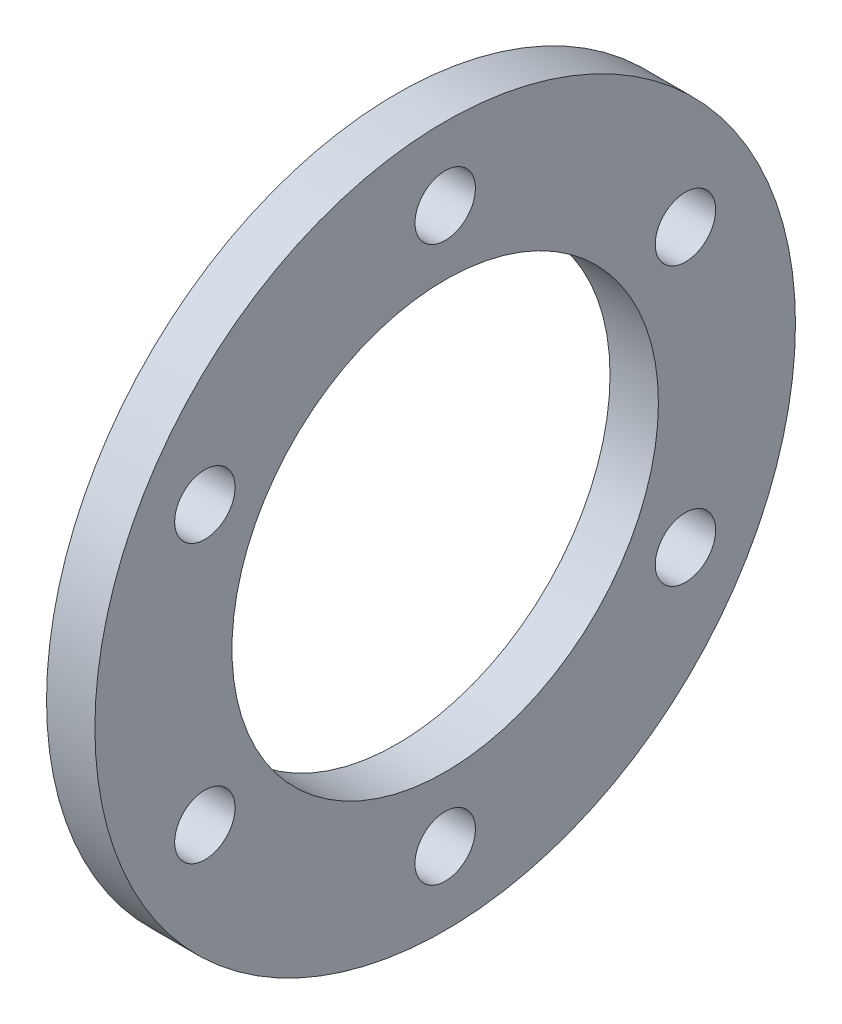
ISO-10303-21;
HEADER;
FILE_DESCRIPTION(('STEP AP214'),'2;1');
FILE_NAME('part.step','',(''),(''),'','','');
FILE_SCHEMA(('AUTOMOTIVE_DESIGN { 1 0 10303 214 1 1 1 1 }'));
ENDSEC;
DATA;
#1=APPLICATION_CONTEXT('core data for automotive mechanical design processes');
#2=APPLICATION_PROTOCOL_DEFINITION('international standard','automotive_design',2000,#1);
#3=PRODUCT_CONTEXT('',#1,'mechanical');
#4=PRODUCT('Part','Part','',(#3));
#5=PRODUCT_RELATED_PRODUCT_CATEGORY('part','',(#4));
#6=PRODUCT_DEFINITION_FORMATION('','',#4);
#7=PRODUCT_DEFINITION_CONTEXT('part definition',#1,'design');
#8=PRODUCT_DEFINITION('design','',#6,#7);
#9=PRODUCT_DEFINITION_SHAPE('','',#8);
#10=(LENGTH_UNIT() NAMED_UNIT(*) SI_UNIT(.MILLI.,.METRE.));
#11=(NAMED_UNIT(*) PLANE_ANGLE_UNIT() SI_UNIT($,.RADIAN.));
#12=(NAMED_UNIT(*) SI_UNIT($,.STERADIAN.) SOLID_ANGLE_UNIT());
#13=UNCERTAINTY_MEASURE_WITH_UNIT(LENGTH_MEASURE(1.E-05),#10,'distance_accuracy_value','');
#14=(GEOMETRIC_REPRESENTATION_CONTEXT(3) GLOBAL_UNCERTAINTY_ASSIGNED_CONTEXT((#13)) GLOBAL_UNIT_ASSIGNED_CONTEXT((#10,
#11,#12)) REPRESENTATION_CONTEXT('',''));
#15=CARTESIAN_POINT('',(0.,0.,0.));
#16=DIRECTION('',(0.,0.,1.));
#17=DIRECTION('',(1.,0.,0.));
#18=AXIS2_PLACEMENT_3D('',#15,#16,#17);
#19=CARTESIAN_POINT('',(6.35,0.,0.));
#20=DIRECTION('',(1.,0.,0.));
#21=DIRECTION('',(0.,0.,-1.));
#22=AXIS2_PLACEMENT_3D('',#19,#20,#21);
#23=PLANE('',#22);
#24=CARTESIAN_POINT('',(6.35,18.2176562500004,31.5539062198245));
#25=DIRECTION('',(1.,0.,0.));
#26=DIRECTION('',(0.,0.866025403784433,-0.50000000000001));
#27=AXIS2_PLACEMENT_3D('',#24,#25,#26);
#28=CIRCLE('',#27,3.96875);
#29=CARTESIAN_POINT('',(6.35,21.6546945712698,29.5695312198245));
#30=VERTEX_POINT('',#29);
#31=EDGE_CURVE('E82',#30,#30,#28,.T.);
#32=ORIENTED_EDGE('',*,*,#31,.F.);
#33=EDGE_LOOP('',(#32));
#34=FACE_BOUND('',#33,.T.);
#35=CARTESIAN_POINT('',(6.35,-18.2176562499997,31.5539062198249));
#36=DIRECTION('',(1.,0.,0.));
#37=DIRECTION('',(0.,0.866025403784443,0.499999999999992));
#38=AXIS2_PLACEMENT_3D('',#35,#36,#37);
#39=CIRCLE('',#38,3.96875);
#40=CARTESIAN_POINT('',(6.35,-14.7806179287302,33.5382812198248));
#41=VERTEX_POINT('',#40);
#42=EDGE_CURVE('E76',#41,#41,#39,.T.);
#43=ORIENTED_EDGE('',*,*,#42,.F.);
#44=EDGE_LOOP('',(#43));
#45=FACE_BOUND('',#44,.T.);
#46=CARTESIAN_POINT('',(6.35,-36.4353125,0.));
#47=DIRECTION('',(1.,0.,0.));
#48=DIRECTION('',(0.,0.,1.));
#49=AXIS2_PLACEMENT_3D('',#46,#47,#48);
#50=CIRCLE('',#49,3.96875);
#51=CARTESIAN_POINT('',(6.35,-36.4353125,3.96875));
#52=VERTEX_POINT('',#51);
#53=EDGE_CURVE('E70',#52,#52,#50,.T.);
#54=ORIENTED_EDGE('',*,*,#53,.F.);
#55=EDGE_LOOP('',(#54));
#56=FACE_BOUND('',#55,.T.);
#57=CARTESIAN_POINT('',(6.35,-18.2176562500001,-31.5539062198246));
#58=DIRECTION('',(1.,0.,0.));
#59=DIRECTION('',(0.,-0.866025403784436,0.500000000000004));
#60=AXIS2_PLACEMENT_3D('',#57,#58,#59);
#61=CIRCLE('',#60,3.96875);
#62=CARTESIAN_POINT('',(6.35,-21.6546945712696,-29.5695312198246));
#63=VERTEX_POINT('',#62);
#64=EDGE_CURVE('E64',#63,#63,#61,.T.);
#65=ORIENTED_EDGE('',*,*,#64,.F.);
#66=EDGE_LOOP('',(#65));
#67=FACE_BOUND('',#66,.T.);
#68=CARTESIAN_POINT('',(6.35,18.2176562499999,-31.5539062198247));
#69=DIRECTION('',(1.,0.,0.));
#70=DIRECTION('',(0.,-0.86602540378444,-0.499999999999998));
#71=AXIS2_PLACEMENT_3D('',#68,#69,#70);
#72=CIRCLE('',#71,3.96875);
#73=CARTESIAN_POINT('',(6.35,14.7806179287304,-33.5382812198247));
#74=VERTEX_POINT('',#73);
#75=EDGE_CURVE('E58',#74,#74,#72,.T.);
#76=ORIENTED_EDGE('',*,*,#75,.F.);
#77=EDGE_LOOP('',(#76));
#78=FACE_BOUND('',#77,.T.);
#79=CARTESIAN_POINT('',(6.35,36.4353125,0.));
#80=DIRECTION('',(1.,0.,0.));
#81=DIRECTION('',(0.,0.,-1.));
#82=AXIS2_PLACEMENT_3D('',#79,#80,#81);
#83=CIRCLE('',#82,3.96875);
#84=CARTESIAN_POINT('',(6.35,36.4353125,-3.96875));
#85=VERTEX_POINT('',#84);
#86=EDGE_CURVE('E52',#85,#85,#83,.T.);
#87=ORIENTED_EDGE('',*,*,#86,.F.);
#88=EDGE_LOOP('',(#87));
#89=FACE_BOUND('',#88,.T.);
#90=CARTESIAN_POINT('',(6.35,0.,0.));
#91=DIRECTION('',(1.,0.,0.));
#92=DIRECTION('',(0.,0.,-1.));
#93=AXIS2_PLACEMENT_3D('',#90,#91,#92);
#94=CIRCLE('',#93,46.);
#95=CARTESIAN_POINT('',(6.35,0.,-46.));
#96=VERTEX_POINT('',#95);
#97=EDGE_CURVE('E10',#96,#96,#94,.T.);
#98=ORIENTED_EDGE('',*,*,#97,.T.);
#99=EDGE_LOOP('',(#98));
#100=FACE_BOUND('',#99,.T.);
#101=CARTESIAN_POINT('',(6.35,0.,0.));
#102=DIRECTION('',(1.,0.,0.));
#103=DIRECTION('',(0.,0.,-1.));
#104=AXIS2_PLACEMENT_3D('',#101,#102,#103);
#105=CIRCLE('',#104,28.);
#106=CARTESIAN_POINT('',(6.35,0.,-28.));
#107=VERTEX_POINT('',#106);
#108=EDGE_CURVE('E44',#107,#107,#105,.T.);
#109=ORIENTED_EDGE('',*,*,#108,.F.);
#110=EDGE_LOOP('',(#109));
#111=FACE_BOUND('',#110,.T.);
#112=ADVANCED_FACE('F33',(#34,#45,#56,#67,#78,#89,#100,#111),#23,.T.);
#113=CARTESIAN_POINT('',(0.,0.,0.));
#114=DIRECTION('',(1.,0.,0.));
#115=DIRECTION('',(0.,0.,-1.));
#116=AXIS2_PLACEMENT_3D('',#113,#114,#115);
#117=PLANE('',#116);
#118=CARTESIAN_POINT('',(0.,18.2176562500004,31.5539062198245));
#119=DIRECTION('',(1.,0.,0.));
#120=DIRECTION('',(0.,0.866025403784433,-0.50000000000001));
#121=AXIS2_PLACEMENT_3D('',#118,#119,#120);
#122=CIRCLE('',#121,3.96875);
#123=CARTESIAN_POINT('',(0.,21.6546945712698,29.5695312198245));
#124=VERTEX_POINT('',#123);
#125=EDGE_CURVE('E79',#124,#124,#122,.T.);
#126=ORIENTED_EDGE('',*,*,#125,.T.);
#127=EDGE_LOOP('',(#126));
#128=FACE_BOUND('',#127,.T.);
#129=CARTESIAN_POINT('',(0.,-18.2176562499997,31.5539062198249));
#130=DIRECTION('',(1.,0.,0.));
#131=DIRECTION('',(0.,0.866025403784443,0.499999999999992));
#132=AXIS2_PLACEMENT_3D('',#129,#130,#131);
#133=CIRCLE('',#132,3.96875);
#134=CARTESIAN_POINT('',(0.,-14.7806179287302,33.5382812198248));
#135=VERTEX_POINT('',#134);
#136=EDGE_CURVE('E73',#135,#135,#133,.T.);
#137=ORIENTED_EDGE('',*,*,#136,.T.);
#138=EDGE_LOOP('',(#137));
#139=FACE_BOUND('',#138,.T.);
#140=CARTESIAN_POINT('',(0.,-36.4353125,0.));
#141=DIRECTION('',(1.,0.,0.));
#142=DIRECTION('',(0.,0.,1.));
#143=AXIS2_PLACEMENT_3D('',#140,#141,#142);
#144=CIRCLE('',#143,3.96875);
#145=CARTESIAN_POINT('',(0.,-36.4353125,3.96875));
#146=VERTEX_POINT('',#145);
#147=EDGE_CURVE('E67',#146,#146,#144,.T.);
#148=ORIENTED_EDGE('',*,*,#147,.T.);
#149=EDGE_LOOP('',(#148));
#150=FACE_BOUND('',#149,.T.);
#151=CARTESIAN_POINT('',(0.,-18.2176562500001,-31.5539062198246));
#152=DIRECTION('',(1.,0.,0.));
#153=DIRECTION('',(0.,-0.866025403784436,0.500000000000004));
#154=AXIS2_PLACEMENT_3D('',#151,#152,#153);
#155=CIRCLE('',#154,3.96875);
#156=CARTESIAN_POINT('',(0.,-21.6546945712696,-29.5695312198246));
#157=VERTEX_POINT('',#156);
#158=EDGE_CURVE('E61',#157,#157,#155,.T.);
#159=ORIENTED_EDGE('',*,*,#158,.T.);
#160=EDGE_LOOP('',(#159));
#161=FACE_BOUND('',#160,.T.);
#162=CARTESIAN_POINT('',(0.,18.2176562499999,-31.5539062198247));
#163=DIRECTION('',(1.,0.,0.));
#164=DIRECTION('',(0.,-0.86602540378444,-0.499999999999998));
#165=AXIS2_PLACEMENT_3D('',#162,#163,#164);
#166=CIRCLE('',#165,3.96875);
#167=CARTESIAN_POINT('',(0.,14.7806179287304,-33.5382812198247));
#168=VERTEX_POINT('',#167);
#169=EDGE_CURVE('E55',#168,#168,#166,.T.);
#170=ORIENTED_EDGE('',*,*,#169,.T.);
#171=EDGE_LOOP('',(#170));
#172=FACE_BOUND('',#171,.T.);
#173=CARTESIAN_POINT('',(0.,36.4353125,0.));
#174=DIRECTION('',(1.,0.,0.));
#175=DIRECTION('',(0.,0.,-1.));
#176=AXIS2_PLACEMENT_3D('',#173,#174,#175);
#177=CIRCLE('',#176,3.96875);
#178=CARTESIAN_POINT('',(0.,36.4353125,-3.96875));
#179=VERTEX_POINT('',#178);
#180=EDGE_CURVE('E49',#179,#179,#177,.T.);
#181=ORIENTED_EDGE('',*,*,#180,.T.);
#182=EDGE_LOOP('',(#181));
#183=FACE_BOUND('',#182,.T.);
#184=CARTESIAN_POINT('',(0.,0.,0.));
#185=DIRECTION('',(1.,0.,0.));
#186=DIRECTION('',(0.,0.,-1.));
#187=AXIS2_PLACEMENT_3D('',#184,#185,#186);
#188=CIRCLE('',#187,46.);
#189=CARTESIAN_POINT('',(0.,0.,-46.));
#190=VERTEX_POINT('',#189);
#191=EDGE_CURVE('E37',#190,#190,#188,.T.);
#192=ORIENTED_EDGE('',*,*,#191,.F.);
#193=EDGE_LOOP('',(#192));
#194=FACE_BOUND('',#193,.T.);
#195=CARTESIAN_POINT('',(0.,0.,0.));
#196=DIRECTION('',(1.,0.,0.));
#197=DIRECTION('',(0.,0.,-1.));
#198=AXIS2_PLACEMENT_3D('',#195,#196,#197);
#199=CIRCLE('',#198,28.);
#200=CARTESIAN_POINT('',(0.,0.,-28.));
#201=VERTEX_POINT('',#200);
#202=EDGE_CURVE('E46',#201,#201,#199,.T.);
#203=ORIENTED_EDGE('',*,*,#202,.T.);
#204=EDGE_LOOP('',(#203));
#205=FACE_BOUND('',#204,.T.);
#206=ADVANCED_FACE('F88',(#128,#139,#150,#161,#172,#183,#194,#205),#117,.F.);
#207=CARTESIAN_POINT('',(6.35,0.,0.));
#208=DIRECTION('',(-1.,0.,0.));
#209=DIRECTION('',(0.,0.,1.));
#210=AXIS2_PLACEMENT_3D('',#207,#208,#209);
#211=CYLINDRICAL_SURFACE('',#210,46.);
#212=ORIENTED_EDGE('',*,*,#97,.F.);
#213=EDGE_LOOP('',(#212));
#214=FACE_BOUND('',#213,.T.);
#215=ORIENTED_EDGE('',*,*,#191,.T.);
#216=EDGE_LOOP('',(#215));
#217=FACE_BOUND('',#216,.T.);
#218=ADVANCED_FACE('F35',(#214,#217),#211,.T.);
#219=CARTESIAN_POINT('',(6.35,0.,0.));
#220=DIRECTION('',(-1.,0.,0.));
#221=DIRECTION('',(0.,0.,1.));
#222=AXIS2_PLACEMENT_3D('',#219,#220,#221);
#223=CYLINDRICAL_SURFACE('',#222,28.);
#224=ORIENTED_EDGE('',*,*,#108,.T.);
#225=EDGE_LOOP('',(#224));
#226=FACE_BOUND('',#225,.T.);
#227=ORIENTED_EDGE('',*,*,#202,.F.);
#228=EDGE_LOOP('',(#227));
#229=FACE_BOUND('',#228,.T.);
#230=ADVANCED_FACE('F113',(#226,#229),#223,.F.);
#231=CARTESIAN_POINT('',(0.,36.4353125,0.));
#232=DIRECTION('',(1.,0.,0.));
#233=DIRECTION('',(0.,0.,-1.));
#234=AXIS2_PLACEMENT_3D('',#231,#232,#233);
#235=CYLINDRICAL_SURFACE('',#234,3.96875);
#236=ORIENTED_EDGE('',*,*,#180,.F.);
#237=EDGE_LOOP('',(#236));
#238=FACE_BOUND('',#237,.T.);
#239=ORIENTED_EDGE('',*,*,#86,.T.);
#240=EDGE_LOOP('',(#239));
#241=FACE_BOUND('',#240,.T.);
#242=ADVANCED_FACE('F116',(#238,#241),#235,.F.);
#243=CARTESIAN_POINT('',(0.,18.2176562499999,-31.5539062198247));
#244=DIRECTION('',(1.,0.,0.));
#245=DIRECTION('',(0.,0.,-1.));
#246=AXIS2_PLACEMENT_3D('',#243,#244,#245);
#247=CYLINDRICAL_SURFACE('',#246,3.96875);
#248=ORIENTED_EDGE('',*,*,#169,.F.);
#249=EDGE_LOOP('',(#248));
#250=FACE_BOUND('',#249,.T.);
#251=ORIENTED_EDGE('',*,*,#75,.T.);
#252=EDGE_LOOP('',(#251));
#253=FACE_BOUND('',#252,.T.);
#254=ADVANCED_FACE('F128',(#250,#253),#247,.F.);
#255=CARTESIAN_POINT('',(0.,-18.2176562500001,-31.5539062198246));
#256=DIRECTION('',(1.,0.,0.));
#257=DIRECTION('',(0.,0.,-1.));
#258=AXIS2_PLACEMENT_3D('',#255,#256,#257);
#259=CYLINDRICAL_SURFACE('',#258,3.96875);
#260=ORIENTED_EDGE('',*,*,#158,.F.);
#261=EDGE_LOOP('',(#260));
#262=FACE_BOUND('',#261,.T.);
#263=ORIENTED_EDGE('',*,*,#64,.T.);
#264=EDGE_LOOP('',(#263));
#265=FACE_BOUND('',#264,.T.);
#266=ADVANCED_FACE('F132',(#262,#265),#259,.F.);
#267=CARTESIAN_POINT('',(0.,-36.4353125,0.));
#268=DIRECTION('',(1.,0.,0.));
#269=DIRECTION('',(0.,0.,-1.));
#270=AXIS2_PLACEMENT_3D('',#267,#268,#269);
#271=CYLINDRICAL_SURFACE('',#270,3.96875);
#272=ORIENTED_EDGE('',*,*,#147,.F.);
#273=EDGE_LOOP('',(#272));
#274=FACE_BOUND('',#273,.T.);
#275=ORIENTED_EDGE('',*,*,#53,.T.);
#276=EDGE_LOOP('',(#275));
#277=FACE_BOUND('',#276,.T.);
#278=ADVANCED_FACE('F136',(#274,#277),#271,.F.);
#279=CARTESIAN_POINT('',(0.,-18.2176562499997,31.5539062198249));
#280=DIRECTION('',(1.,0.,0.));
#281=DIRECTION('',(0.,0.,-1.));
#282=AXIS2_PLACEMENT_3D('',#279,#280,#281);
#283=CYLINDRICAL_SURFACE('',#282,3.96875);
#284=ORIENTED_EDGE('',*,*,#136,.F.);
#285=EDGE_LOOP('',(#284));
#286=FACE_BOUND('',#285,.T.);
#287=ORIENTED_EDGE('',*,*,#42,.T.);
#288=EDGE_LOOP('',(#287));
#289=FACE_BOUND('',#288,.T.);
#290=ADVANCED_FACE('F94',(#286,#289),#283,.F.);
#291=CARTESIAN_POINT('',(0.,18.2176562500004,31.5539062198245));
#292=DIRECTION('',(1.,0.,0.));
#293=DIRECTION('',(0.,0.,-1.));
#294=AXIS2_PLACEMENT_3D('',#291,#292,#293);
#295=CYLINDRICAL_SURFACE('',#294,3.96875);
#296=ORIENTED_EDGE('',*,*,#125,.F.);
#297=EDGE_LOOP('',(#296));
#298=FACE_BOUND('',#297,.T.);
#299=ORIENTED_EDGE('',*,*,#31,.T.);
#300=EDGE_LOOP('',(#299));
#301=FACE_BOUND('',#300,.T.);
#302=ADVANCED_FACE('F91',(#298,#301),#295,.F.);
#303=CLOSED_SHELL('',(#112,#206,#218,#230,#242,#254,#266,#278,#290,#302));
#304=MANIFOLD_SOLID_BREP('B2',#303);
#305=ADVANCED_BREP_SHAPE_REPRESENTATION('',(#18,#304),#14);
#306=SHAPE_DEFINITION_REPRESENTATION(#9,#305);
ENDSEC;
END-ISO-10303-21;
